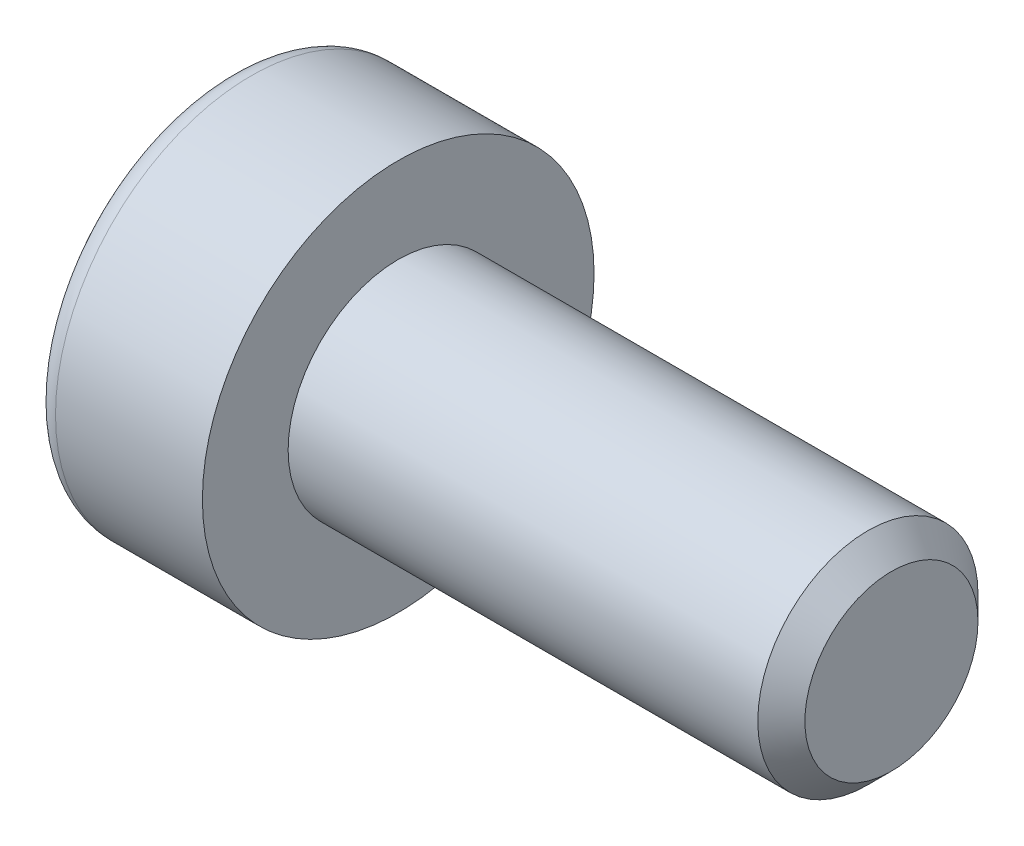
from build123d import *

# Parameters (mm, degrees)
ENL_V_MAT_EXTRU_1_DEPTH = 2
CONG_1_R                = 0.5


with BuildPart() as part:
    # Esquisse1 → R_volution2 (revolve)
    with BuildSketch(Plane.XY, mode=Mode.PRIVATE) as r_volution2_sk:
        Polygon((-324.272441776, -82.233261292), (-324.272441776, -80.350712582), (-324.784792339, -79.838362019), (-335, -79.838362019), (-335, -77.973749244), (-338.695213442, -77.973749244), (-338.695213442, -82.233261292), align=None)
    revolve(r_volution2_sk.sketch.rotate(Axis((-324.272441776, -82.233261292, 0), (-1, 0, 0)), 90), axis=Axis((-324.272441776, -82.233261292, 0), (-1, 0, 0)))

    # Esquisse2 → Enl_v. mat.-Extru.1 (cut)
    with BuildSketch(Plane.ZY.offset(338.695213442)):
        Polygon((-0.337114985, -79.829469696), (-2.25030208, -81.323315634), (-1.913187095, -83.72710723), (0.337114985, -84.637052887), (2.25030208, -83.143206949), (1.913187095, -80.739415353), align=None)
    extrude(amount=-ENL_V_MAT_EXTRU_1_DEPTH, mode=Mode.SUBTRACT)

    # Cong_1
    cong_1_edges = [part.edges().sort_by_distance(p)[0] for p in [
        (-338.695213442, -82.233261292, 4.259512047),
    ]]
    fillet(cong_1_edges, radius=CONG_1_R)


solid = part.part
